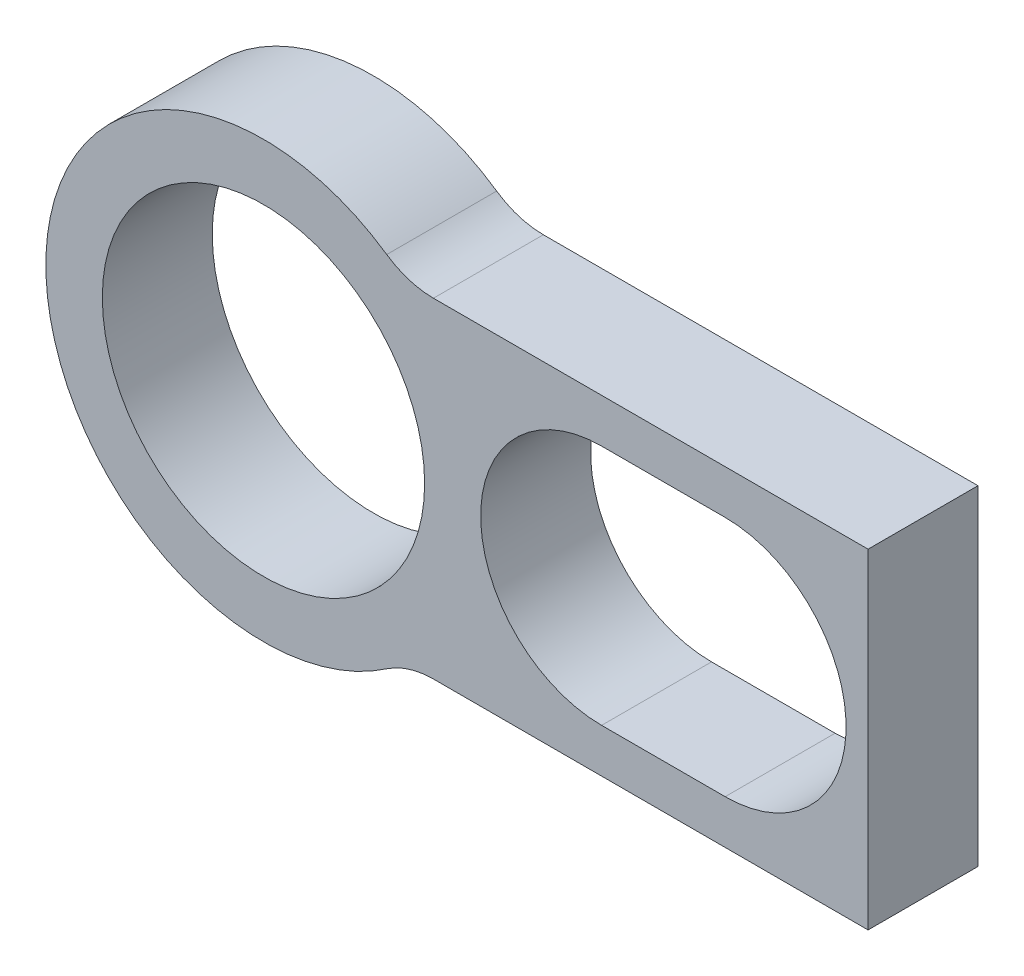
ISO-10303-21;
HEADER;
FILE_DESCRIPTION(('STEP AP214'),'2;1');
FILE_NAME('part.step','',(''),(''),'','','');
FILE_SCHEMA(('AUTOMOTIVE_DESIGN { 1 0 10303 214 1 1 1 1 }'));
ENDSEC;
DATA;
#1=APPLICATION_CONTEXT('core data for automotive mechanical design processes');
#2=APPLICATION_PROTOCOL_DEFINITION('international standard','automotive_design',2000,#1);
#3=PRODUCT_CONTEXT('',#1,'mechanical');
#4=PRODUCT('Part','Part','',(#3));
#5=PRODUCT_RELATED_PRODUCT_CATEGORY('part','',(#4));
#6=PRODUCT_DEFINITION_FORMATION('','',#4);
#7=PRODUCT_DEFINITION_CONTEXT('part definition',#1,'design');
#8=PRODUCT_DEFINITION('design','',#6,#7);
#9=PRODUCT_DEFINITION_SHAPE('','',#8);
#10=(LENGTH_UNIT() NAMED_UNIT(*) SI_UNIT(.MILLI.,.METRE.));
#11=(NAMED_UNIT(*) PLANE_ANGLE_UNIT() SI_UNIT($,.RADIAN.));
#12=(NAMED_UNIT(*) SI_UNIT($,.STERADIAN.) SOLID_ANGLE_UNIT());
#13=UNCERTAINTY_MEASURE_WITH_UNIT(LENGTH_MEASURE(1.E-05),#10,'distance_accuracy_value','');
#14=(GEOMETRIC_REPRESENTATION_CONTEXT(3) GLOBAL_UNCERTAINTY_ASSIGNED_CONTEXT((#13)) GLOBAL_UNIT_ASSIGNED_CONTEXT((#10,
#11,#12)) REPRESENTATION_CONTEXT('',''));
#15=CARTESIAN_POINT('',(0.,0.,0.));
#16=DIRECTION('',(0.,0.,1.));
#17=DIRECTION('',(1.,0.,0.));
#18=AXIS2_PLACEMENT_3D('',#15,#16,#17);
#19=CARTESIAN_POINT('',(0.,0.,3.175));
#20=DIRECTION('',(0.,0.,1.));
#21=DIRECTION('',(1.,0.,0.));
#22=AXIS2_PLACEMENT_3D('',#19,#20,#21);
#23=PLANE('',#22);
#24=CARTESIAN_POINT('',(26.67,0.,3.175));
#25=DIRECTION('',(0.,0.,-1.));
#26=DIRECTION('',(-1.,0.,0.));
#27=AXIS2_PLACEMENT_3D('',#24,#25,#26);
#28=CIRCLE('',#27,6.985);
#29=CARTESIAN_POINT('',(26.67,6.98499999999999,3.175));
#30=VERTEX_POINT('',#29);
#31=CARTESIAN_POINT('',(26.67,-6.985,3.175));
#32=VERTEX_POINT('',#31);
#33=EDGE_CURVE('E141',#30,#32,#28,.T.);
#34=ORIENTED_EDGE('',*,*,#33,.T.);
#35=DIRECTION('',(-1.,0.,0.));
#36=VECTOR('',#35,1.);
#37=CARTESIAN_POINT('',(26.67,-6.985,3.175));
#38=LINE('',#37,#36);
#39=CARTESIAN_POINT('',(19.5326,-6.985,3.175));
#40=VERTEX_POINT('',#39);
#41=EDGE_CURVE('E147',#32,#40,#38,.T.);
#42=ORIENTED_EDGE('',*,*,#41,.T.);
#43=CARTESIAN_POINT('',(19.5326,0.,3.175));
#44=DIRECTION('',(0.,0.,-1.));
#45=DIRECTION('',(-1.,0.,0.));
#46=AXIS2_PLACEMENT_3D('',#43,#44,#45);
#47=CIRCLE('',#46,6.985);
#48=CARTESIAN_POINT('',(19.5326,6.98499999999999,3.175));
#49=VERTEX_POINT('',#48);
#50=EDGE_CURVE('E122',#40,#49,#47,.T.);
#51=ORIENTED_EDGE('',*,*,#50,.T.);
#52=DIRECTION('',(1.,0.,0.));
#53=VECTOR('',#52,1.);
#54=CARTESIAN_POINT('',(26.67,6.98499999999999,3.175));
#55=LINE('',#54,#53);
#56=EDGE_CURVE('E150',#49,#30,#55,.T.);
#57=ORIENTED_EDGE('',*,*,#56,.T.);
#58=EDGE_LOOP('',(#34,#42,#51,#57));
#59=FACE_BOUND('',#58,.T.);
#60=DIRECTION('',(-1.,0.,0.));
#61=VECTOR('',#60,1.);
#62=CARTESIAN_POINT('',(34.925,9.525,3.175));
#63=LINE('',#62,#61);
#64=CARTESIAN_POINT('',(34.925,9.525,3.175));
#65=VERTEX_POINT('',#64);
#66=CARTESIAN_POINT('',(9.81768322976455,9.525,3.175));
#67=VERTEX_POINT('',#66);
#68=EDGE_CURVE('E166',#65,#67,#63,.T.);
#69=ORIENTED_EDGE('',*,*,#68,.T.);
#70=CARTESIAN_POINT('',(9.81768322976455,14.2875,3.175));
#71=DIRECTION('',(0.,0.,1.));
#72=DIRECTION('',(1.,0.,0.));
#73=AXIS2_PLACEMENT_3D('',#70,#71,#72);
#74=CIRCLE('',#73,4.7625);
#75=CARTESIAN_POINT('',(7.12051750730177,10.3623626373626,3.175));
#76=VERTEX_POINT('',#75);
#77=EDGE_CURVE('E11',#67,#76,#74,.F.);
#78=ORIENTED_EDGE('',*,*,#77,.T.);
#79=CARTESIAN_POINT('',(0.,0.,3.175));
#80=DIRECTION('',(0.,0.,1.));
#81=DIRECTION('',(1.,0.,0.));
#82=AXIS2_PLACEMENT_3D('',#79,#80,#81);
#83=CIRCLE('',#82,12.573);
#84=CARTESIAN_POINT('',(7.12051750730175,-10.3623626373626,3.175));
#85=VERTEX_POINT('',#84);
#86=EDGE_CURVE('E175',#76,#85,#83,.T.);
#87=ORIENTED_EDGE('',*,*,#86,.T.);
#88=CARTESIAN_POINT('',(9.81768322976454,-14.2875,3.175));
#89=DIRECTION('',(0.,0.,1.));
#90=DIRECTION('',(1.,0.,0.));
#91=AXIS2_PLACEMENT_3D('',#88,#89,#90);
#92=CIRCLE('',#91,4.7625);
#93=CARTESIAN_POINT('',(9.81768322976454,-9.525,3.175));
#94=VERTEX_POINT('',#93);
#95=EDGE_CURVE('E188',#85,#94,#92,.F.);
#96=ORIENTED_EDGE('',*,*,#95,.T.);
#97=DIRECTION('',(1.,0.,0.));
#98=VECTOR('',#97,1.);
#99=CARTESIAN_POINT('',(34.925,-9.52500000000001,3.175));
#100=LINE('',#99,#98);
#101=CARTESIAN_POINT('',(34.925,-9.52500000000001,3.175));
#102=VERTEX_POINT('',#101);
#103=EDGE_CURVE('E159',#94,#102,#100,.T.);
#104=ORIENTED_EDGE('',*,*,#103,.T.);
#105=DIRECTION('',(0.,1.,0.));
#106=VECTOR('',#105,1.);
#107=CARTESIAN_POINT('',(34.925,12.573,3.175));
#108=LINE('',#107,#106);
#109=EDGE_CURVE('E177',#102,#65,#108,.T.);
#110=ORIENTED_EDGE('',*,*,#109,.T.);
#111=EDGE_LOOP('',(#69,#78,#87,#96,#104,#110));
#112=FACE_BOUND('',#111,.T.);
#113=CARTESIAN_POINT('',(0.,0.,3.175));
#114=DIRECTION('',(0.,0.,1.));
#115=DIRECTION('',(1.,0.,0.));
#116=AXIS2_PLACEMENT_3D('',#113,#114,#115);
#117=CIRCLE('',#116,9.3091);
#118=CARTESIAN_POINT('',(9.3091,0.,3.175));
#119=VERTEX_POINT('',#118);
#120=EDGE_CURVE('E379',#119,#119,#117,.T.);
#121=ORIENTED_EDGE('',*,*,#120,.F.);
#122=EDGE_LOOP('',(#121));
#123=FACE_BOUND('',#122,.T.);
#124=ADVANCED_FACE('F38',(#59,#112,#123),#23,.T.);
#125=CARTESIAN_POINT('',(0.,0.,-3.175));
#126=DIRECTION('',(0.,0.,1.));
#127=DIRECTION('',(1.,0.,0.));
#128=AXIS2_PLACEMENT_3D('',#125,#126,#127);
#129=PLANE('',#128);
#130=DIRECTION('',(-1.,0.,0.));
#131=VECTOR('',#130,1.);
#132=CARTESIAN_POINT('',(26.67,-6.985,-3.175));
#133=LINE('',#132,#131);
#134=CARTESIAN_POINT('',(26.67,-6.985,-3.175));
#135=VERTEX_POINT('',#134);
#136=CARTESIAN_POINT('',(19.5326,-6.985,-3.175));
#137=VERTEX_POINT('',#136);
#138=EDGE_CURVE('E131',#135,#137,#133,.T.);
#139=ORIENTED_EDGE('',*,*,#138,.F.);
#140=CARTESIAN_POINT('',(26.67,0.,-3.175));
#141=DIRECTION('',(0.,0.,-1.));
#142=DIRECTION('',(-1.,0.,0.));
#143=AXIS2_PLACEMENT_3D('',#140,#141,#142);
#144=CIRCLE('',#143,6.985);
#145=CARTESIAN_POINT('',(26.67,6.98499999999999,-3.175));
#146=VERTEX_POINT('',#145);
#147=EDGE_CURVE('E135',#146,#135,#144,.T.);
#148=ORIENTED_EDGE('',*,*,#147,.F.);
#149=DIRECTION('',(1.,0.,0.));
#150=VECTOR('',#149,1.);
#151=CARTESIAN_POINT('',(26.67,6.98499999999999,-3.175));
#152=LINE('',#151,#150);
#153=CARTESIAN_POINT('',(19.5326,6.98499999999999,-3.175));
#154=VERTEX_POINT('',#153);
#155=EDGE_CURVE('E139',#154,#146,#152,.T.);
#156=ORIENTED_EDGE('',*,*,#155,.F.);
#157=CARTESIAN_POINT('',(19.5326,0.,-3.175));
#158=DIRECTION('',(0.,0.,-1.));
#159=DIRECTION('',(-1.,0.,0.));
#160=AXIS2_PLACEMENT_3D('',#157,#158,#159);
#161=CIRCLE('',#160,6.985);
#162=EDGE_CURVE('E119',#137,#154,#161,.T.);
#163=ORIENTED_EDGE('',*,*,#162,.F.);
#164=EDGE_LOOP('',(#139,#148,#156,#163));
#165=FACE_BOUND('',#164,.T.);
#166=DIRECTION('',(1.,0.,0.));
#167=VECTOR('',#166,1.);
#168=CARTESIAN_POINT('',(34.925,-9.52500000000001,-3.175));
#169=LINE('',#168,#167);
#170=CARTESIAN_POINT('',(9.81768322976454,-9.525,-3.175));
#171=VERTEX_POINT('',#170);
#172=CARTESIAN_POINT('',(34.925,-9.52500000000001,-3.175));
#173=VERTEX_POINT('',#172);
#174=EDGE_CURVE('E155',#171,#173,#169,.T.);
#175=ORIENTED_EDGE('',*,*,#174,.F.);
#176=CARTESIAN_POINT('',(9.81768322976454,-14.2875,-3.175));
#177=DIRECTION('',(0.,0.,1.));
#178=DIRECTION('',(1.,0.,0.));
#179=AXIS2_PLACEMENT_3D('',#176,#177,#178);
#180=CIRCLE('',#179,4.7625);
#181=CARTESIAN_POINT('',(7.12051750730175,-10.3623626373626,-3.175));
#182=VERTEX_POINT('',#181);
#183=EDGE_CURVE('E185',#171,#182,#180,.T.);
#184=ORIENTED_EDGE('',*,*,#183,.T.);
#185=CARTESIAN_POINT('',(0.,0.,-3.175));
#186=DIRECTION('',(0.,0.,1.));
#187=DIRECTION('',(1.,0.,0.));
#188=AXIS2_PLACEMENT_3D('',#185,#186,#187);
#189=CIRCLE('',#188,12.573);
#190=CARTESIAN_POINT('',(7.12051750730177,10.3623626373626,-3.175));
#191=VERTEX_POINT('',#190);
#192=EDGE_CURVE('E171',#191,#182,#189,.T.);
#193=ORIENTED_EDGE('',*,*,#192,.F.);
#194=CARTESIAN_POINT('',(9.81768322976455,14.2875,-3.175));
#195=DIRECTION('',(0.,0.,1.));
#196=DIRECTION('',(1.,0.,0.));
#197=AXIS2_PLACEMENT_3D('',#194,#195,#196);
#198=CIRCLE('',#197,4.7625);
#199=CARTESIAN_POINT('',(9.81768322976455,9.525,-3.175));
#200=VERTEX_POINT('',#199);
#201=EDGE_CURVE('E46',#191,#200,#198,.T.);
#202=ORIENTED_EDGE('',*,*,#201,.T.);
#203=DIRECTION('',(-1.,0.,0.));
#204=VECTOR('',#203,1.);
#205=CARTESIAN_POINT('',(34.925,9.525,-3.175));
#206=LINE('',#205,#204);
#207=CARTESIAN_POINT('',(34.925,9.525,-3.175));
#208=VERTEX_POINT('',#207);
#209=EDGE_CURVE('E164',#208,#200,#206,.T.);
#210=ORIENTED_EDGE('',*,*,#209,.F.);
#211=DIRECTION('',(0.,1.,0.));
#212=VECTOR('',#211,1.);
#213=CARTESIAN_POINT('',(34.925,12.573,-3.175));
#214=LINE('',#213,#212);
#215=EDGE_CURVE('E173',#173,#208,#214,.T.);
#216=ORIENTED_EDGE('',*,*,#215,.F.);
#217=EDGE_LOOP('',(#175,#184,#193,#202,#210,#216));
#218=FACE_BOUND('',#217,.T.);
#219=CARTESIAN_POINT('',(0.,0.,-3.175));
#220=DIRECTION('',(0.,0.,1.));
#221=DIRECTION('',(1.,0.,0.));
#222=AXIS2_PLACEMENT_3D('',#219,#220,#221);
#223=CIRCLE('',#222,9.3091);
#224=CARTESIAN_POINT('',(9.3091,0.,-3.175));
#225=VERTEX_POINT('',#224);
#226=EDGE_CURVE('E377',#225,#225,#223,.F.);
#227=ORIENTED_EDGE('',*,*,#226,.F.);
#228=EDGE_LOOP('',(#227));
#229=FACE_BOUND('',#228,.T.);
#230=ADVANCED_FACE('F137',(#165,#218,#229),#129,.F.);
#231=CARTESIAN_POINT('',(0.,0.,3.175));
#232=DIRECTION('',(0.,0.,-1.));
#233=DIRECTION('',(-1.,0.,0.));
#234=AXIS2_PLACEMENT_3D('',#231,#232,#233);
#235=CYLINDRICAL_SURFACE('',#234,12.573);
#236=ORIENTED_EDGE('',*,*,#86,.F.);
#237=DIRECTION('',(0.,0.,-1.));
#238=VECTOR('',#237,1.);
#239=CARTESIAN_POINT('',(7.12051750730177,10.3623626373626,3.175));
#240=LINE('',#239,#238);
#241=EDGE_CURVE('E190',#76,#191,#240,.T.);
#242=ORIENTED_EDGE('',*,*,#241,.T.);
#243=ORIENTED_EDGE('',*,*,#192,.T.);
#244=DIRECTION('',(0.,0.,-1.));
#245=VECTOR('',#244,1.);
#246=CARTESIAN_POINT('',(7.12051750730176,-10.3623626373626,3.175));
#247=LINE('',#246,#245);
#248=EDGE_CURVE('E182',#182,#85,#247,.F.);
#249=ORIENTED_EDGE('',*,*,#248,.T.);
#250=EDGE_LOOP('',(#236,#242,#243,#249));
#251=FACE_BOUND('',#250,.T.);
#252=ADVANCED_FACE('F40',(#251),#235,.T.);
#253=CARTESIAN_POINT('',(34.925,12.573,3.175));
#254=DIRECTION('',(-1.,0.,0.));
#255=DIRECTION('',(0.,0.,1.));
#256=AXIS2_PLACEMENT_3D('',#253,#254,#255);
#257=PLANE('',#256);
#258=ORIENTED_EDGE('',*,*,#109,.F.);
#259=DIRECTION('',(0.,0.,-1.));
#260=VECTOR('',#259,1.);
#261=CARTESIAN_POINT('',(34.925,-9.52500000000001,3.175));
#262=LINE('',#261,#260);
#263=EDGE_CURVE('E161',#102,#173,#262,.T.);
#264=ORIENTED_EDGE('',*,*,#263,.T.);
#265=ORIENTED_EDGE('',*,*,#215,.T.);
#266=DIRECTION('',(0.,0.,-1.));
#267=VECTOR('',#266,1.);
#268=CARTESIAN_POINT('',(34.925,9.525,3.175));
#269=LINE('',#268,#267);
#270=EDGE_CURVE('E168',#65,#208,#269,.T.);
#271=ORIENTED_EDGE('',*,*,#270,.F.);
#272=EDGE_LOOP('',(#258,#264,#265,#271));
#273=FACE_BOUND('',#272,.T.);
#274=ADVANCED_FACE('F215',(#273),#257,.F.);
#275=CARTESIAN_POINT('',(34.925,9.525,3.175));
#276=DIRECTION('',(0.,-1.,0.));
#277=DIRECTION('',(0.,0.,-1.));
#278=AXIS2_PLACEMENT_3D('',#275,#276,#277);
#279=PLANE('',#278);
#280=ORIENTED_EDGE('',*,*,#209,.T.);
#281=DIRECTION('',(0.,0.,1.));
#282=VECTOR('',#281,1.);
#283=CARTESIAN_POINT('',(9.81768322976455,9.525,3.175));
#284=LINE('',#283,#282);
#285=EDGE_CURVE('E53',#200,#67,#284,.T.);
#286=ORIENTED_EDGE('',*,*,#285,.T.);
#287=ORIENTED_EDGE('',*,*,#68,.F.);
#288=ORIENTED_EDGE('',*,*,#270,.T.);
#289=EDGE_LOOP('',(#280,#286,#287,#288));
#290=FACE_BOUND('',#289,.T.);
#291=ADVANCED_FACE('F216',(#290),#279,.F.);
#292=CARTESIAN_POINT('',(34.925,-9.52500000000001,3.175));
#293=DIRECTION('',(0.,1.,0.));
#294=DIRECTION('',(-1.,0.,0.));
#295=AXIS2_PLACEMENT_3D('',#292,#293,#294);
#296=PLANE('',#295);
#297=ORIENTED_EDGE('',*,*,#103,.F.);
#298=DIRECTION('',(0.,0.,1.));
#299=VECTOR('',#298,1.);
#300=CARTESIAN_POINT('',(9.81768322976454,-9.525,-3.175));
#301=LINE('',#300,#299);
#302=EDGE_CURVE('E179',#94,#171,#301,.F.);
#303=ORIENTED_EDGE('',*,*,#302,.T.);
#304=ORIENTED_EDGE('',*,*,#174,.T.);
#305=ORIENTED_EDGE('',*,*,#263,.F.);
#306=EDGE_LOOP('',(#297,#303,#304,#305));
#307=FACE_BOUND('',#306,.T.);
#308=ADVANCED_FACE('F211',(#307),#296,.F.);
#309=CARTESIAN_POINT('',(26.67,0.,3.175));
#310=DIRECTION('',(0.,0.,-1.));
#311=DIRECTION('',(-1.,0.,0.));
#312=AXIS2_PLACEMENT_3D('',#309,#310,#311);
#313=CYLINDRICAL_SURFACE('',#312,6.985);
#314=ORIENTED_EDGE('',*,*,#147,.T.);
#315=DIRECTION('',(0.,0.,-1.));
#316=VECTOR('',#315,1.);
#317=CARTESIAN_POINT('',(26.67,-6.985,3.175));
#318=LINE('',#317,#316);
#319=EDGE_CURVE('E127',#32,#135,#318,.T.);
#320=ORIENTED_EDGE('',*,*,#319,.F.);
#321=ORIENTED_EDGE('',*,*,#33,.F.);
#322=DIRECTION('',(0.,0.,-1.));
#323=VECTOR('',#322,1.);
#324=CARTESIAN_POINT('',(26.67,6.98499999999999,3.175));
#325=LINE('',#324,#323);
#326=EDGE_CURVE('E153',#30,#146,#325,.T.);
#327=ORIENTED_EDGE('',*,*,#326,.T.);
#328=EDGE_LOOP('',(#314,#320,#321,#327));
#329=FACE_BOUND('',#328,.T.);
#330=ADVANCED_FACE('F299',(#329),#313,.F.);
#331=CARTESIAN_POINT('',(26.67,6.98499999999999,3.175));
#332=DIRECTION('',(0.,1.,0.));
#333=DIRECTION('',(0.,0.,1.));
#334=AXIS2_PLACEMENT_3D('',#331,#332,#333);
#335=PLANE('',#334);
#336=ORIENTED_EDGE('',*,*,#155,.T.);
#337=ORIENTED_EDGE('',*,*,#326,.F.);
#338=ORIENTED_EDGE('',*,*,#56,.F.);
#339=DIRECTION('',(0.,0.,-1.));
#340=VECTOR('',#339,1.);
#341=CARTESIAN_POINT('',(19.5326,6.98499999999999,3.175));
#342=LINE('',#341,#340);
#343=EDGE_CURVE('E126',#49,#154,#342,.T.);
#344=ORIENTED_EDGE('',*,*,#343,.T.);
#345=EDGE_LOOP('',(#336,#337,#338,#344));
#346=FACE_BOUND('',#345,.T.);
#347=ADVANCED_FACE('F317',(#346),#335,.F.);
#348=CARTESIAN_POINT('',(19.5326,0.,3.175));
#349=DIRECTION('',(0.,0.,-1.));
#350=DIRECTION('',(-1.,0.,0.));
#351=AXIS2_PLACEMENT_3D('',#348,#349,#350);
#352=CYLINDRICAL_SURFACE('',#351,6.985);
#353=ORIENTED_EDGE('',*,*,#162,.T.);
#354=ORIENTED_EDGE('',*,*,#343,.F.);
#355=ORIENTED_EDGE('',*,*,#50,.F.);
#356=DIRECTION('',(0.,0.,-1.));
#357=VECTOR('',#356,1.);
#358=CARTESIAN_POINT('',(19.5326,-6.985,3.175));
#359=LINE('',#358,#357);
#360=EDGE_CURVE('E115',#40,#137,#359,.T.);
#361=ORIENTED_EDGE('',*,*,#360,.T.);
#362=EDGE_LOOP('',(#353,#354,#355,#361));
#363=FACE_BOUND('',#362,.T.);
#364=ADVANCED_FACE('F117',(#363),#352,.F.);
#365=CARTESIAN_POINT('',(26.67,-6.985,3.175));
#366=DIRECTION('',(0.,-1.,0.));
#367=DIRECTION('',(1.,0.,0.));
#368=AXIS2_PLACEMENT_3D('',#365,#366,#367);
#369=PLANE('',#368);
#370=ORIENTED_EDGE('',*,*,#138,.T.);
#371=ORIENTED_EDGE('',*,*,#360,.F.);
#372=ORIENTED_EDGE('',*,*,#41,.F.);
#373=ORIENTED_EDGE('',*,*,#319,.T.);
#374=EDGE_LOOP('',(#370,#371,#372,#373));
#375=FACE_BOUND('',#374,.T.);
#376=ADVANCED_FACE('F132',(#375),#369,.F.);
#377=CARTESIAN_POINT('',(9.81768322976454,-14.2875,3.175));
#378=DIRECTION('',(0.,0.,-1.));
#379=DIRECTION('',(-1.,0.,0.));
#380=AXIS2_PLACEMENT_3D('',#377,#378,#379);
#381=CYLINDRICAL_SURFACE('',#380,4.7625);
#382=ORIENTED_EDGE('',*,*,#95,.F.);
#383=ORIENTED_EDGE('',*,*,#248,.F.);
#384=ORIENTED_EDGE('',*,*,#183,.F.);
#385=ORIENTED_EDGE('',*,*,#302,.F.);
#386=EDGE_LOOP('',(#382,#383,#384,#385));
#387=FACE_BOUND('',#386,.T.);
#388=ADVANCED_FACE('F205',(#387),#381,.F.);
#389=CARTESIAN_POINT('',(9.81768322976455,14.2875,3.175));
#390=DIRECTION('',(0.,0.,-1.));
#391=DIRECTION('',(-1.,0.,0.));
#392=AXIS2_PLACEMENT_3D('',#389,#390,#391);
#393=CYLINDRICAL_SURFACE('',#392,4.7625);
#394=ORIENTED_EDGE('',*,*,#77,.F.);
#395=ORIENTED_EDGE('',*,*,#285,.F.);
#396=ORIENTED_EDGE('',*,*,#201,.F.);
#397=ORIENTED_EDGE('',*,*,#241,.F.);
#398=EDGE_LOOP('',(#394,#395,#396,#397));
#399=FACE_BOUND('',#398,.T.);
#400=ADVANCED_FACE('F217',(#399),#393,.F.);
#401=CARTESIAN_POINT('',(0.,0.,-29.6847160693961));
#402=DIRECTION('',(0.,0.,1.));
#403=DIRECTION('',(1.,0.,0.));
#404=AXIS2_PLACEMENT_3D('',#401,#402,#403);
#405=CYLINDRICAL_SURFACE('',#404,9.3091);
#406=ORIENTED_EDGE('',*,*,#226,.T.);
#407=EDGE_LOOP('',(#406));
#408=FACE_BOUND('',#407,.T.);
#409=ORIENTED_EDGE('',*,*,#120,.T.);
#410=EDGE_LOOP('',(#409));
#411=FACE_BOUND('',#410,.T.);
#412=ADVANCED_FACE('F219',(#408,#411),#405,.F.);
#413=CLOSED_SHELL('',(#124,#230,#252,#274,#291,#308,#330,#347,#364,#376,#388,#400,#412));
#414=MANIFOLD_SOLID_BREP('B2',#413);
#415=ADVANCED_BREP_SHAPE_REPRESENTATION('',(#18,#414),#14);
#416=SHAPE_DEFINITION_REPRESENTATION(#9,#415);
ENDSEC;
END-ISO-10303-21;
